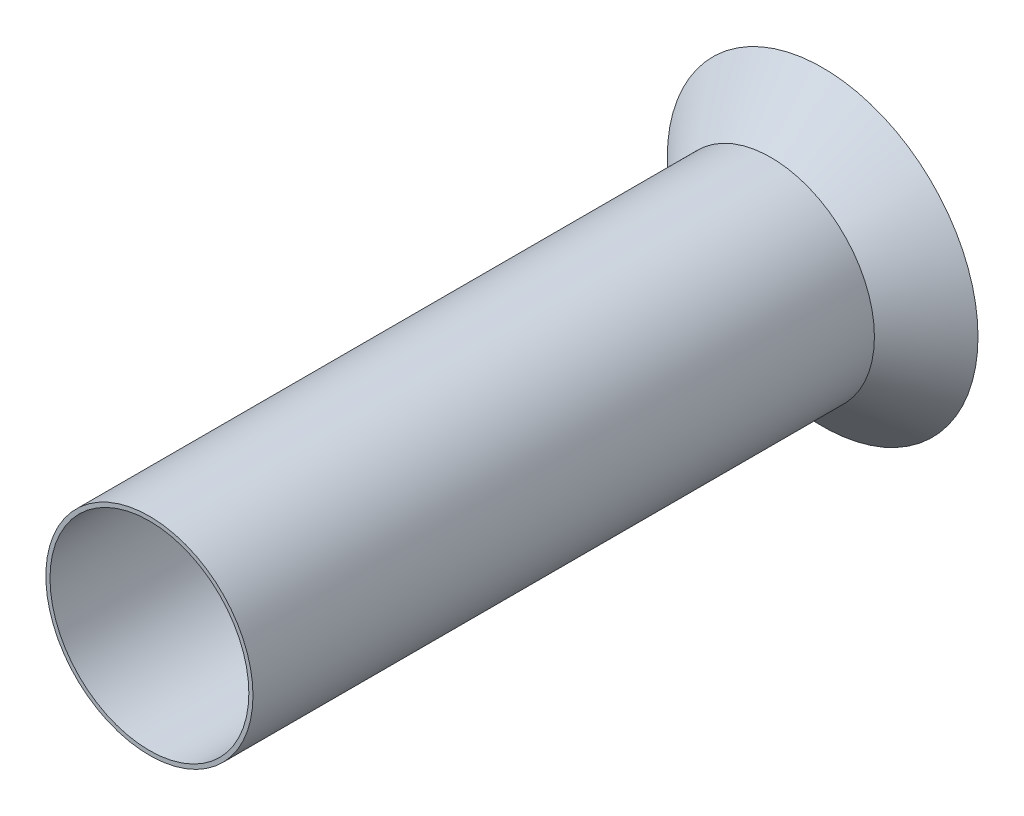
ISO-10303-21;
HEADER;
FILE_DESCRIPTION(('STEP AP214'),'2;1');
FILE_NAME('part.step','',(''),(''),'','','');
FILE_SCHEMA(('AUTOMOTIVE_DESIGN { 1 0 10303 214 1 1 1 1 }'));
ENDSEC;
DATA;
#1=APPLICATION_CONTEXT('core data for automotive mechanical design processes');
#2=APPLICATION_PROTOCOL_DEFINITION('international standard','automotive_design',2000,#1);
#3=PRODUCT_CONTEXT('',#1,'mechanical');
#4=PRODUCT('Part','Part','',(#3));
#5=PRODUCT_RELATED_PRODUCT_CATEGORY('part','',(#4));
#6=PRODUCT_DEFINITION_FORMATION('','',#4);
#7=PRODUCT_DEFINITION_CONTEXT('part definition',#1,'design');
#8=PRODUCT_DEFINITION('design','',#6,#7);
#9=PRODUCT_DEFINITION_SHAPE('','',#8);
#10=(LENGTH_UNIT() NAMED_UNIT(*) SI_UNIT(.MILLI.,.METRE.));
#11=(NAMED_UNIT(*) PLANE_ANGLE_UNIT() SI_UNIT($,.RADIAN.));
#12=(NAMED_UNIT(*) SI_UNIT($,.STERADIAN.) SOLID_ANGLE_UNIT());
#13=UNCERTAINTY_MEASURE_WITH_UNIT(LENGTH_MEASURE(1.E-05),#10,'distance_accuracy_value','');
#14=(GEOMETRIC_REPRESENTATION_CONTEXT(3) GLOBAL_UNCERTAINTY_ASSIGNED_CONTEXT((#13)) GLOBAL_UNIT_ASSIGNED_CONTEXT((#10,
#11,#12)) REPRESENTATION_CONTEXT('',''));
#15=CARTESIAN_POINT('',(0.,0.,0.));
#16=DIRECTION('',(0.,0.,1.));
#17=DIRECTION('',(1.,0.,0.));
#18=AXIS2_PLACEMENT_3D('',#15,#16,#17);
#19=CARTESIAN_POINT('',(0.,0.,300.));
#20=DIRECTION('',(0.,0.,-1.));
#21=DIRECTION('',(-1.,0.,0.));
#22=AXIS2_PLACEMENT_3D('',#19,#20,#21);
#23=CYLINDRICAL_SURFACE('',#22,50.);
#24=CARTESIAN_POINT('',(0.,0.,300.));
#25=DIRECTION('',(0.,0.,1.));
#26=DIRECTION('',(1.,0.,0.));
#27=AXIS2_PLACEMENT_3D('',#24,#25,#26);
#28=CIRCLE('',#27,50.);
#29=CARTESIAN_POINT('',(50.,0.,300.));
#30=VERTEX_POINT('',#29);
#31=EDGE_CURVE('E11',#30,#30,#28,.T.);
#32=ORIENTED_EDGE('',*,*,#31,.F.);
#33=EDGE_LOOP('',(#32));
#34=FACE_BOUND('',#33,.T.);
#35=CARTESIAN_POINT('',(0.,0.,0.));
#36=DIRECTION('',(0.,0.,1.));
#37=DIRECTION('',(1.,0.,0.));
#38=AXIS2_PLACEMENT_3D('',#35,#36,#37);
#39=CIRCLE('',#38,50.);
#40=CARTESIAN_POINT('',(50.,0.,0.));
#41=VERTEX_POINT('',#40);
#42=EDGE_CURVE('E37',#41,#41,#39,.T.);
#43=ORIENTED_EDGE('',*,*,#42,.T.);
#44=EDGE_LOOP('',(#43));
#45=FACE_BOUND('',#44,.T.);
#46=ADVANCED_FACE('F33',(#34,#45),#23,.T.);
#47=CARTESIAN_POINT('',(0.,0.,300.));
#48=DIRECTION('',(0.,0.,1.));
#49=DIRECTION('',(1.,0.,0.));
#50=AXIS2_PLACEMENT_3D('',#47,#48,#49);
#51=PLANE('',#50);
#52=CARTESIAN_POINT('',(0.,0.,300.));
#53=DIRECTION('',(0.,0.,1.));
#54=DIRECTION('',(1.,0.,0.));
#55=AXIS2_PLACEMENT_3D('',#52,#53,#54);
#56=CIRCLE('',#55,48.);
#57=CARTESIAN_POINT('',(48.,0.,300.));
#58=VERTEX_POINT('',#57);
#59=EDGE_CURVE('E108',#58,#58,#56,.T.);
#60=ORIENTED_EDGE('',*,*,#59,.F.);
#61=EDGE_LOOP('',(#60));
#62=FACE_BOUND('',#61,.T.);
#63=ORIENTED_EDGE('',*,*,#31,.T.);
#64=EDGE_LOOP('',(#63));
#65=FACE_BOUND('',#64,.T.);
#66=ADVANCED_FACE('F122',(#62,#65),#51,.T.);
#67=CARTESIAN_POINT('',(0.,0.,-25.));
#68=DIRECTION('',(0.,0.,-1.));
#69=DIRECTION('',(-1.,0.,0.));
#70=AXIS2_PLACEMENT_3D('',#67,#68,#69);
#71=PLANE('',#70);
#72=CARTESIAN_POINT('',(0.,0.,-25.));
#73=DIRECTION('',(0.,0.,-1.));
#74=DIRECTION('',(-1.,0.,0.));
#75=AXIS2_PLACEMENT_3D('',#72,#73,#74);
#76=CIRCLE('',#75,72.1715728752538);
#77=CARTESIAN_POINT('',(-72.1715728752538,0.,-25.));
#78=VERTEX_POINT('',#77);
#79=EDGE_CURVE('E66',#78,#78,#76,.T.);
#80=ORIENTED_EDGE('',*,*,#79,.F.);
#81=EDGE_LOOP('',(#80));
#82=FACE_BOUND('',#81,.T.);
#83=CARTESIAN_POINT('',(0.,0.,-25.));
#84=DIRECTION('',(0.,0.,-1.));
#85=DIRECTION('',(-1.,0.,0.));
#86=AXIS2_PLACEMENT_3D('',#83,#84,#85);
#87=CIRCLE('',#86,75.);
#88=CARTESIAN_POINT('',(-75.,0.,-25.));
#89=VERTEX_POINT('',#88);
#90=EDGE_CURVE('E46',#89,#89,#87,.T.);
#91=ORIENTED_EDGE('',*,*,#90,.T.);
#92=EDGE_LOOP('',(#91));
#93=FACE_BOUND('',#92,.T.);
#94=ADVANCED_FACE('F84',(#82,#93),#71,.T.);
#95=CARTESIAN_POINT('',(0.,0.,0.));
#96=DIRECTION('',(0.,0.,-1.));
#97=DIRECTION('',(-1.,0.,0.));
#98=AXIS2_PLACEMENT_3D('',#95,#96,#97);
#99=CONICAL_SURFACE('',#98,50.,0.785398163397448);
#100=ORIENTED_EDGE('',*,*,#42,.F.);
#101=EDGE_LOOP('',(#100));
#102=FACE_BOUND('',#101,.T.);
#103=ORIENTED_EDGE('',*,*,#90,.F.);
#104=EDGE_LOOP('',(#103));
#105=FACE_BOUND('',#104,.T.);
#106=ADVANCED_FACE('F62',(#102,#105),#99,.T.);
#107=CARTESIAN_POINT('',(0.,0.,300.));
#108=DIRECTION('',(0.,0.,-1.));
#109=DIRECTION('',(-1.,0.,0.));
#110=AXIS2_PLACEMENT_3D('',#107,#108,#109);
#111=CYLINDRICAL_SURFACE('',#110,48.);
#112=ORIENTED_EDGE('',*,*,#59,.T.);
#113=EDGE_LOOP('',(#112));
#114=FACE_BOUND('',#113,.T.);
#115=CARTESIAN_POINT('',(0.,0.,-0.828427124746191));
#116=DIRECTION('',(0.,0.,-1.));
#117=DIRECTION('',(-1.,0.,0.));
#118=AXIS2_PLACEMENT_3D('',#115,#116,#117);
#119=CIRCLE('',#118,48.);
#120=CARTESIAN_POINT('',(-48.,0.,-0.828427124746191));
#121=VERTEX_POINT('',#120);
#122=EDGE_CURVE('E110',#121,#121,#119,.F.);
#123=ORIENTED_EDGE('',*,*,#122,.F.);
#124=EDGE_LOOP('',(#123));
#125=FACE_BOUND('',#124,.T.);
#126=ADVANCED_FACE('F83',(#114,#125),#111,.F.);
#127=CARTESIAN_POINT('',(0.,0.,-1.4142135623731));
#128=DIRECTION('',(0.,0.,-1.));
#129=DIRECTION('',(-1.,0.,0.));
#130=AXIS2_PLACEMENT_3D('',#127,#128,#129);
#131=CONICAL_SURFACE('',#130,48.5857864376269,0.785398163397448);
#132=ORIENTED_EDGE('',*,*,#122,.T.);
#133=EDGE_LOOP('',(#132));
#134=FACE_BOUND('',#133,.T.);
#135=ORIENTED_EDGE('',*,*,#79,.T.);
#136=EDGE_LOOP('',(#135));
#137=FACE_BOUND('',#136,.T.);
#138=ADVANCED_FACE('F85',(#134,#137),#131,.F.);
#139=CLOSED_SHELL('',(#46,#66,#94,#106,#126,#138));
#140=MANIFOLD_SOLID_BREP('B2',#139);
#141=ADVANCED_BREP_SHAPE_REPRESENTATION('',(#18,#140),#14);
#142=SHAPE_DEFINITION_REPRESENTATION(#9,#141);
ENDSEC;
END-ISO-10303-21;
